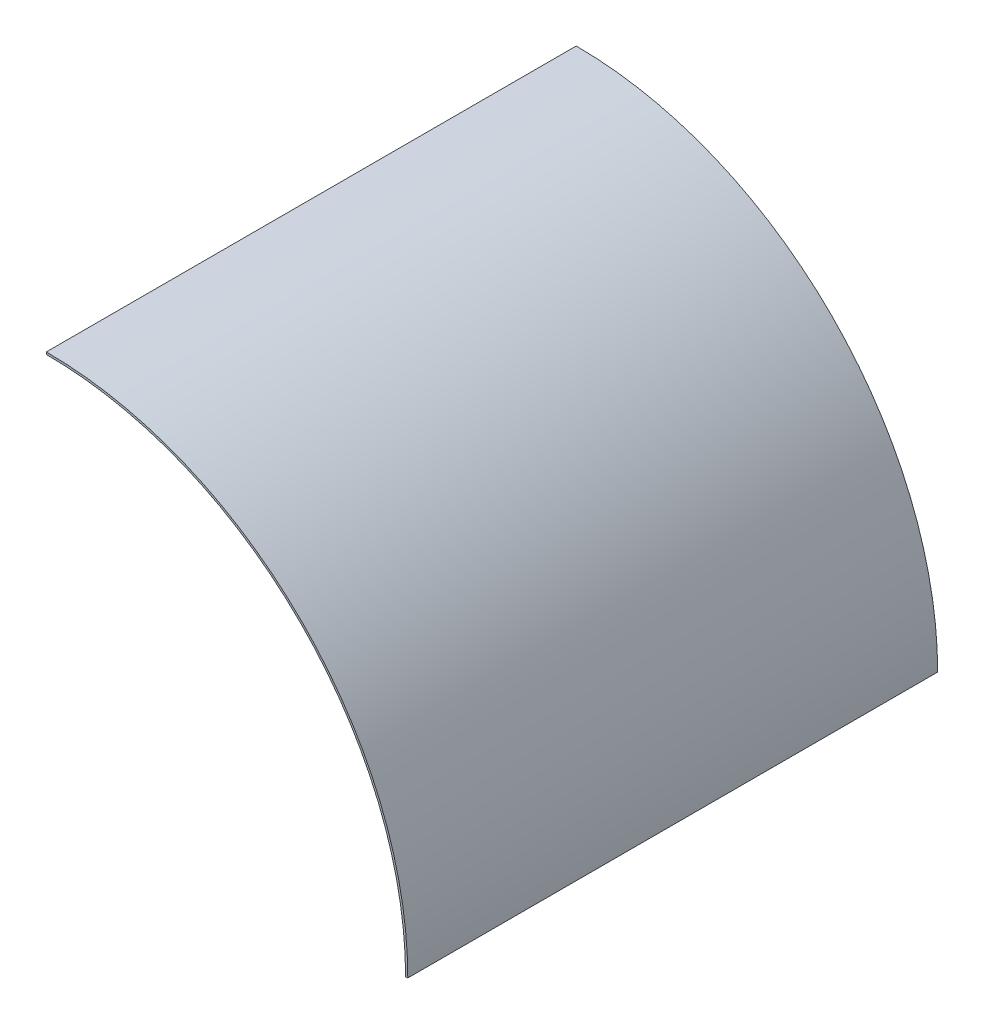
ISO-10303-21;
HEADER;
FILE_DESCRIPTION(('STEP AP214'),'2;1');
FILE_NAME('part.step','',(''),(''),'','','');
FILE_SCHEMA(('AUTOMOTIVE_DESIGN { 1 0 10303 214 1 1 1 1 }'));
ENDSEC;
DATA;
#1=APPLICATION_CONTEXT('core data for automotive mechanical design processes');
#2=APPLICATION_PROTOCOL_DEFINITION('international standard','automotive_design',2000,#1);
#3=PRODUCT_CONTEXT('',#1,'mechanical');
#4=PRODUCT('Part','Part','',(#3));
#5=PRODUCT_RELATED_PRODUCT_CATEGORY('part','',(#4));
#6=PRODUCT_DEFINITION_FORMATION('','',#4);
#7=PRODUCT_DEFINITION_CONTEXT('part definition',#1,'design');
#8=PRODUCT_DEFINITION('design','',#6,#7);
#9=PRODUCT_DEFINITION_SHAPE('','',#8);
#10=(LENGTH_UNIT() NAMED_UNIT(*) SI_UNIT(.MILLI.,.METRE.));
#11=(NAMED_UNIT(*) PLANE_ANGLE_UNIT() SI_UNIT($,.RADIAN.));
#12=(NAMED_UNIT(*) SI_UNIT($,.STERADIAN.) SOLID_ANGLE_UNIT());
#13=UNCERTAINTY_MEASURE_WITH_UNIT(LENGTH_MEASURE(1.E-05),#10,'distance_accuracy_value','');
#14=(GEOMETRIC_REPRESENTATION_CONTEXT(3) GLOBAL_UNCERTAINTY_ASSIGNED_CONTEXT((#13)) GLOBAL_UNIT_ASSIGNED_CONTEXT((#10,
#11,#12)) REPRESENTATION_CONTEXT('',''));
#15=CARTESIAN_POINT('',(0.,0.,0.));
#16=DIRECTION('',(0.,0.,1.));
#17=DIRECTION('',(1.,0.,0.));
#18=AXIS2_PLACEMENT_3D('',#15,#16,#17);
#19=CARTESIAN_POINT('',(0.,0.,-3000.));
#20=DIRECTION('',(0.,0.,1.));
#21=DIRECTION('',(1.,0.,0.));
#22=AXIS2_PLACEMENT_3D('',#19,#20,#21);
#23=CYLINDRICAL_SURFACE('',#22,2034.);
#24=CARTESIAN_POINT('',(0.,0.,0.));
#25=DIRECTION('',(0.,0.,-1.));
#26=DIRECTION('',(-1.,0.,0.));
#27=AXIS2_PLACEMENT_3D('',#24,#25,#26);
#28=CIRCLE('',#27,2034.);
#29=CARTESIAN_POINT('',(0.,2034.,0.));
#30=VERTEX_POINT('',#29);
#31=CARTESIAN_POINT('',(2034.,0.,0.));
#32=VERTEX_POINT('',#31);
#33=EDGE_CURVE('E109',#30,#32,#28,.T.);
#34=ORIENTED_EDGE('',*,*,#33,.F.);
#35=DIRECTION('',(0.,0.,1.));
#36=VECTOR('',#35,1.);
#37=CARTESIAN_POINT('',(0.,2034.,-3000.));
#38=LINE('',#37,#36);
#39=CARTESIAN_POINT('',(0.,2034.,-3000.));
#40=VERTEX_POINT('',#39);
#41=EDGE_CURVE('E11',#40,#30,#38,.T.);
#42=ORIENTED_EDGE('',*,*,#41,.F.);
#43=CARTESIAN_POINT('',(0.,0.,-3000.));
#44=DIRECTION('',(0.,0.,-1.));
#45=DIRECTION('',(-1.,0.,0.));
#46=AXIS2_PLACEMENT_3D('',#43,#44,#45);
#47=CIRCLE('',#46,2034.);
#48=CARTESIAN_POINT('',(2034.,0.,-3000.));
#49=VERTEX_POINT('',#48);
#50=EDGE_CURVE('E101',#40,#49,#47,.T.);
#51=ORIENTED_EDGE('',*,*,#50,.T.);
#52=DIRECTION('',(0.,0.,1.));
#53=VECTOR('',#52,1.);
#54=CARTESIAN_POINT('',(2034.,0.,-3000.));
#55=LINE('',#54,#53);
#56=EDGE_CURVE('E42',#49,#32,#55,.T.);
#57=ORIENTED_EDGE('',*,*,#56,.T.);
#58=EDGE_LOOP('',(#34,#42,#51,#57));
#59=FACE_BOUND('',#58,.T.);
#60=ADVANCED_FACE('F39',(#59),#23,.F.);
#61=CARTESIAN_POINT('',(0.,2046.5,-3000.));
#62=DIRECTION('',(-1.,0.,0.));
#63=DIRECTION('',(0.,0.,1.));
#64=AXIS2_PLACEMENT_3D('',#61,#62,#63);
#65=PLANE('',#64);
#66=DIRECTION('',(0.,-1.,0.));
#67=VECTOR('',#66,1.);
#68=CARTESIAN_POINT('',(0.,2046.5,0.));
#69=LINE('',#68,#67);
#70=CARTESIAN_POINT('',(0.,2046.5,0.));
#71=VERTEX_POINT('',#70);
#72=EDGE_CURVE('E104',#71,#30,#69,.T.);
#73=ORIENTED_EDGE('',*,*,#72,.F.);
#74=DIRECTION('',(0.,0.,1.));
#75=VECTOR('',#74,1.);
#76=CARTESIAN_POINT('',(0.,2046.5,-3000.));
#77=LINE('',#76,#75);
#78=CARTESIAN_POINT('',(0.,2046.5,-3000.));
#79=VERTEX_POINT('',#78);
#80=EDGE_CURVE('E49',#79,#71,#77,.T.);
#81=ORIENTED_EDGE('',*,*,#80,.F.);
#82=DIRECTION('',(0.,-1.,0.));
#83=VECTOR('',#82,1.);
#84=CARTESIAN_POINT('',(0.,2046.5,-3000.));
#85=LINE('',#84,#83);
#86=EDGE_CURVE('E96',#79,#40,#85,.T.);
#87=ORIENTED_EDGE('',*,*,#86,.T.);
#88=ORIENTED_EDGE('',*,*,#41,.T.);
#89=EDGE_LOOP('',(#73,#81,#87,#88));
#90=FACE_BOUND('',#89,.T.);
#91=ADVANCED_FACE('F125',(#90),#65,.T.);
#92=CARTESIAN_POINT('',(0.,0.,-3000.));
#93=DIRECTION('',(0.,0.,1.));
#94=DIRECTION('',(1.,0.,0.));
#95=AXIS2_PLACEMENT_3D('',#92,#93,#94);
#96=CYLINDRICAL_SURFACE('',#95,2046.5);
#97=CARTESIAN_POINT('',(0.,0.,0.));
#98=DIRECTION('',(0.,0.,1.));
#99=DIRECTION('',(-1.,0.,0.));
#100=AXIS2_PLACEMENT_3D('',#97,#98,#99);
#101=CIRCLE('',#100,2046.5);
#102=CARTESIAN_POINT('',(2046.5,2.50623967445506E-13,0.));
#103=VERTEX_POINT('',#102);
#104=EDGE_CURVE('E90',#103,#71,#101,.T.);
#105=ORIENTED_EDGE('',*,*,#104,.F.);
#106=DIRECTION('',(0.,0.,1.));
#107=VECTOR('',#106,1.);
#108=CARTESIAN_POINT('',(2046.5,2.50623967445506E-13,-3000.));
#109=LINE('',#108,#107);
#110=CARTESIAN_POINT('',(2046.5,2.50623967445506E-13,-3000.));
#111=VERTEX_POINT('',#110);
#112=EDGE_CURVE('E85',#111,#103,#109,.T.);
#113=ORIENTED_EDGE('',*,*,#112,.F.);
#114=CARTESIAN_POINT('',(0.,0.,-3000.));
#115=DIRECTION('',(0.,0.,1.));
#116=DIRECTION('',(-1.,0.,0.));
#117=AXIS2_PLACEMENT_3D('',#114,#115,#116);
#118=CIRCLE('',#117,2046.5);
#119=EDGE_CURVE('E88',#111,#79,#118,.T.);
#120=ORIENTED_EDGE('',*,*,#119,.T.);
#121=ORIENTED_EDGE('',*,*,#80,.T.);
#122=EDGE_LOOP('',(#105,#113,#120,#121));
#123=FACE_BOUND('',#122,.T.);
#124=ADVANCED_FACE('F87',(#123),#96,.T.);
#125=CARTESIAN_POINT('',(2046.5,0.,-3000.));
#126=DIRECTION('',(0.,-1.,0.));
#127=DIRECTION('',(0.,0.,-1.));
#128=AXIS2_PLACEMENT_3D('',#125,#126,#127);
#129=PLANE('',#128);
#130=DIRECTION('',(1.,0.,0.));
#131=VECTOR('',#130,1.);
#132=CARTESIAN_POINT('',(2046.5,0.,0.));
#133=LINE('',#132,#131);
#134=EDGE_CURVE('E113',#32,#103,#133,.T.);
#135=ORIENTED_EDGE('',*,*,#134,.F.);
#136=ORIENTED_EDGE('',*,*,#56,.F.);
#137=DIRECTION('',(1.,0.,0.));
#138=VECTOR('',#137,1.);
#139=CARTESIAN_POINT('',(2046.5,0.,-3000.));
#140=LINE('',#139,#138);
#141=EDGE_CURVE('E95',#49,#111,#140,.T.);
#142=ORIENTED_EDGE('',*,*,#141,.T.);
#143=ORIENTED_EDGE('',*,*,#112,.T.);
#144=EDGE_LOOP('',(#135,#136,#142,#143));
#145=FACE_BOUND('',#144,.T.);
#146=ADVANCED_FACE('F99',(#145),#129,.T.);
#147=CARTESIAN_POINT('',(0.,0.,-3000.));
#148=DIRECTION('',(0.,0.,-1.));
#149=DIRECTION('',(-1.,0.,0.));
#150=AXIS2_PLACEMENT_3D('',#147,#148,#149);
#151=PLANE('',#150);
#152=ORIENTED_EDGE('',*,*,#50,.F.);
#153=ORIENTED_EDGE('',*,*,#86,.F.);
#154=ORIENTED_EDGE('',*,*,#119,.F.);
#155=ORIENTED_EDGE('',*,*,#141,.F.);
#156=EDGE_LOOP('',(#152,#153,#154,#155));
#157=FACE_BOUND('',#156,.T.);
#158=ADVANCED_FACE('F94',(#157),#151,.T.);
#159=CARTESIAN_POINT('',(0.,0.,0.));
#160=DIRECTION('',(0.,0.,-1.));
#161=DIRECTION('',(-1.,0.,0.));
#162=AXIS2_PLACEMENT_3D('',#159,#160,#161);
#163=PLANE('',#162);
#164=ORIENTED_EDGE('',*,*,#33,.T.);
#165=ORIENTED_EDGE('',*,*,#134,.T.);
#166=ORIENTED_EDGE('',*,*,#104,.T.);
#167=ORIENTED_EDGE('',*,*,#72,.T.);
#168=EDGE_LOOP('',(#164,#165,#166,#167));
#169=FACE_BOUND('',#168,.T.);
#170=ADVANCED_FACE('F124',(#169),#163,.F.);
#171=CLOSED_SHELL('',(#60,#91,#124,#146,#158,#170));
#172=MANIFOLD_SOLID_BREP('B2',#171);
#173=ADVANCED_BREP_SHAPE_REPRESENTATION('',(#18,#172),#14);
#174=SHAPE_DEFINITION_REPRESENTATION(#9,#173);
ENDSEC;
END-ISO-10303-21;
